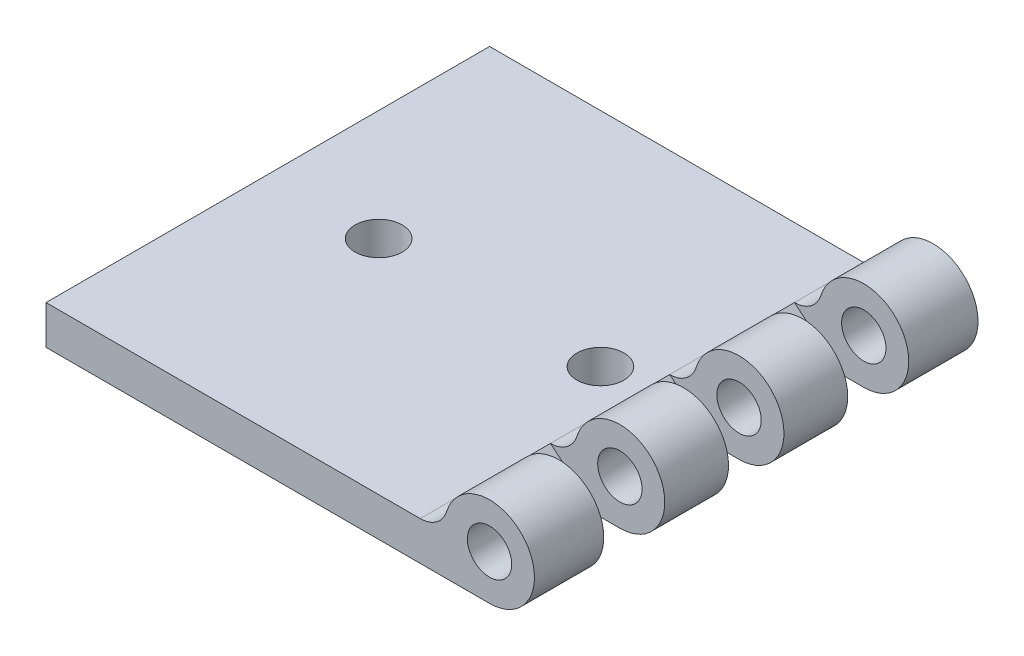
from build123d import *

# Parameters (mm, degrees)
SKIZZE1_R                       = 4
LINEAR_AUSTRAGEN1_DEPTH         = 80
SKIZZE2_W                       = 11
SKIZZE2_H                       = 26.745741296
SKIZZE2_W_2                     = 10
SKIZZE2_H_2                     = 30.496341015
SCHNITT_LINEAR_AUSTRAGEN1_DEPTH = 107.172186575
SKIZZE3_R                       = 4.25
SCHNITT_LINEAR_AUSTRAGEN2_DEPTH = 114.510528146


with BuildPart() as part:
    # Skizze1 → Linear austragen1 (new body)
    with BuildSketch(Plane.XY):
        with BuildLine():
            Line((0, 0), (-80, 0))
            Line((-80, 0), (-80, 7))
            Line((-80, 7), (-12.505998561, 7))
            ThreePointArc((-12.505998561, 7), (-9.543123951, 7.972423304), (-7.732716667, 10.511450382))
            ThreePointArc((-7.732716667, 10.511450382), (6.524674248, 12.899856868), (0, 0))
        make_face()
        with Locations((0, 8.1)):
            Circle(SKIZZE1_R, mode=Mode.SUBTRACT)
    extrude(amount=LINEAR_AUSTRAGEN1_DEPTH)

    # Skizze2 → Schnitt-Linear austragen1 (cut, through all)
    with BuildSketch(Plane(origin=(-10.785648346, 9.050233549, 0), x_dir=(0, 0, 1), z_dir=(0.7660444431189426, -0.6427876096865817, 0))):
        with Locations((62, -10.696480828)):
            Rectangle(SKIZZE2_W, SKIZZE2_H)
        with Locations((40, -10.696480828)):
            Rectangle(SKIZZE2_W_2, SKIZZE2_H)
        with Locations((18, -12.571780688)):
            Rectangle(SKIZZE2_W, SKIZZE2_H_2)
    extrude(amount=SCHNITT_LINEAR_AUSTRAGEN1_DEPTH, mode=Mode.SUBTRACT)

    # Skizze3 → Schnitt-Linear austragen2 (cut, through all)
    with BuildSketch(Plane(origin=(0, 7, 0), x_dir=(1, 0, 0), z_dir=(0, 1, 0))):
        with Locations(Location((-60, -40, 0), (0, 0, 180))):
            Circle(SKIZZE3_R)
        with Locations(Location((-20, -40, 0), (0, 0, 180))):
            Circle(SKIZZE3_R)
    extrude(amount=-SCHNITT_LINEAR_AUSTRAGEN2_DEPTH, mode=Mode.SUBTRACT)


solid = part.part
